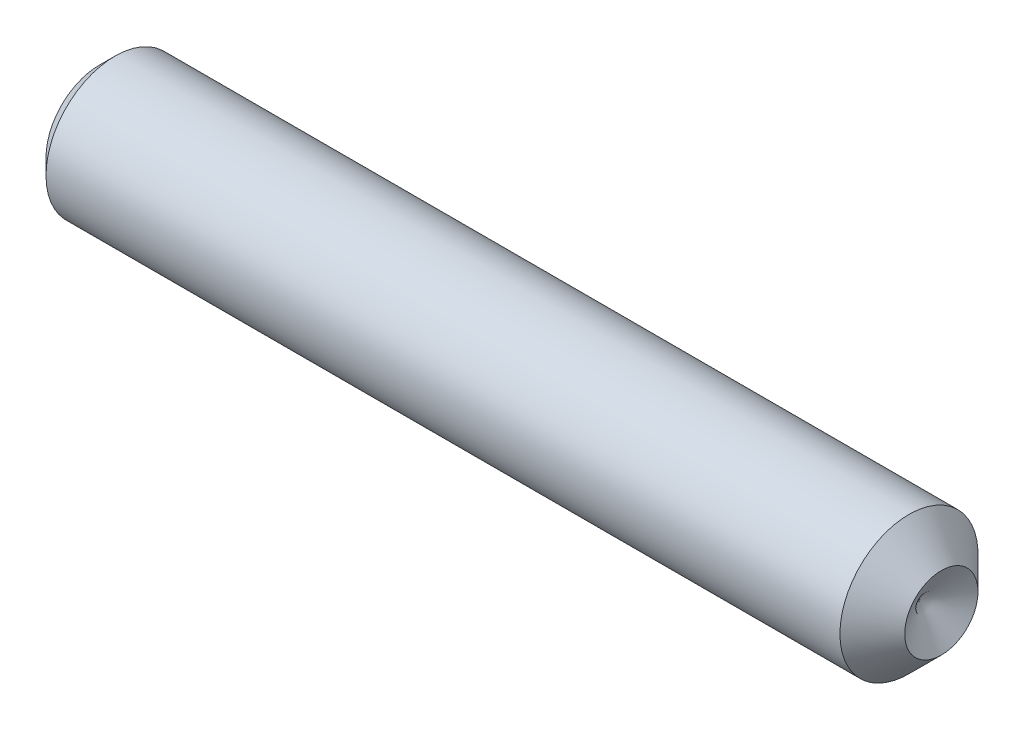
ISO-10303-21;
HEADER;
FILE_DESCRIPTION(('STEP AP214'),'2;1');
FILE_NAME('part.step','',(''),(''),'','','');
FILE_SCHEMA(('AUTOMOTIVE_DESIGN { 1 0 10303 214 1 1 1 1 }'));
ENDSEC;
DATA;
#1=APPLICATION_CONTEXT('core data for automotive mechanical design processes');
#2=APPLICATION_PROTOCOL_DEFINITION('international standard','automotive_design',2000,#1);
#3=PRODUCT_CONTEXT('',#1,'mechanical');
#4=PRODUCT('Part','Part','',(#3));
#5=PRODUCT_RELATED_PRODUCT_CATEGORY('part','',(#4));
#6=PRODUCT_DEFINITION_FORMATION('','',#4);
#7=PRODUCT_DEFINITION_CONTEXT('part definition',#1,'design');
#8=PRODUCT_DEFINITION('design','',#6,#7);
#9=PRODUCT_DEFINITION_SHAPE('','',#8);
#10=(LENGTH_UNIT() NAMED_UNIT(*) SI_UNIT(.MILLI.,.METRE.));
#11=(NAMED_UNIT(*) PLANE_ANGLE_UNIT() SI_UNIT($,.RADIAN.));
#12=(NAMED_UNIT(*) SI_UNIT($,.STERADIAN.) SOLID_ANGLE_UNIT());
#13=UNCERTAINTY_MEASURE_WITH_UNIT(LENGTH_MEASURE(1.E-05),#10,'distance_accuracy_value','');
#14=(GEOMETRIC_REPRESENTATION_CONTEXT(3) GLOBAL_UNCERTAINTY_ASSIGNED_CONTEXT((#13)) GLOBAL_UNIT_ASSIGNED_CONTEXT((#10,
#11,#12)) REPRESENTATION_CONTEXT('',''));
#15=CARTESIAN_POINT('',(0.,0.,0.));
#16=DIRECTION('',(0.,0.,1.));
#17=DIRECTION('',(1.,0.,0.));
#18=AXIS2_PLACEMENT_3D('',#15,#16,#17);
#19=CARTESIAN_POINT('',(0.,0.,0.));
#20=DIRECTION('',(-1.,0.,0.));
#21=DIRECTION('',(0.,0.,1.));
#22=AXIS2_PLACEMENT_3D('',#19,#20,#21);
#23=PLANE('',#22);
#24=CARTESIAN_POINT('',(0.,0.,0.));
#25=DIRECTION('',(-1.,0.,0.));
#26=DIRECTION('',(0.,0.,1.));
#27=AXIS2_PLACEMENT_3D('',#24,#25,#26);
#28=CIRCLE('',#27,1.61036);
#29=CARTESIAN_POINT('',(0.,0.,1.61036));
#30=VERTEX_POINT('',#29);
#31=EDGE_CURVE('E11',#30,#30,#28,.T.);
#32=ORIENTED_EDGE('',*,*,#31,.T.);
#33=EDGE_LOOP('',(#32));
#34=FACE_BOUND('',#33,.T.);
#35=DIRECTION('',(0.,0.,-1.));
#36=VECTOR('',#35,1.);
#37=CARTESIAN_POINT('',(0.,0.990600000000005,0.571923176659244));
#38=LINE('',#37,#36);
#39=CARTESIAN_POINT('',(0.,0.990600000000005,0.571923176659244));
#40=VERTEX_POINT('',#39);
#41=CARTESIAN_POINT('',(0.,0.990600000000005,-0.571923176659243));
#42=VERTEX_POINT('',#41);
#43=EDGE_CURVE('E94',#40,#42,#38,.T.);
#44=ORIENTED_EDGE('',*,*,#43,.F.);
#45=DIRECTION('',(0.,-0.866025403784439,0.5));
#46=VECTOR('',#45,1.);
#47=CARTESIAN_POINT('',(0.,0.990600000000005,0.571923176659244));
#48=LINE('',#47,#46);
#49=CARTESIAN_POINT('',(0.,0.,1.14384635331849));
#50=VERTEX_POINT('',#49);
#51=EDGE_CURVE('E47',#40,#50,#48,.T.);
#52=ORIENTED_EDGE('',*,*,#51,.T.);
#53=DIRECTION('',(0.,0.866025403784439,0.5));
#54=VECTOR('',#53,1.);
#55=CARTESIAN_POINT('',(0.,-0.990599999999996,0.571923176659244));
#56=LINE('',#55,#54);
#57=CARTESIAN_POINT('',(0.,-0.990599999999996,0.571923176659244));
#58=VERTEX_POINT('',#57);
#59=EDGE_CURVE('E100',#58,#50,#56,.T.);
#60=ORIENTED_EDGE('',*,*,#59,.F.);
#61=DIRECTION('',(0.,0.,-1.));
#62=VECTOR('',#61,1.);
#63=CARTESIAN_POINT('',(0.,-0.990599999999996,0.571923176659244));
#64=LINE('',#63,#62);
#65=CARTESIAN_POINT('',(0.,-0.990599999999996,-0.571923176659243));
#66=VERTEX_POINT('',#65);
#67=EDGE_CURVE('E120',#58,#66,#64,.T.);
#68=ORIENTED_EDGE('',*,*,#67,.T.);
#69=DIRECTION('',(0.,0.866025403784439,-0.5));
#70=VECTOR('',#69,1.);
#71=CARTESIAN_POINT('',(0.,-0.990599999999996,-0.571923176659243));
#72=LINE('',#71,#70);
#73=CARTESIAN_POINT('',(0.,0.,-1.14384635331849));
#74=VERTEX_POINT('',#73);
#75=EDGE_CURVE('E123',#66,#74,#72,.T.);
#76=ORIENTED_EDGE('',*,*,#75,.T.);
#77=DIRECTION('',(0.,-0.866025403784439,-0.5));
#78=VECTOR('',#77,1.);
#79=CARTESIAN_POINT('',(0.,0.990600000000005,-0.571923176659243));
#80=LINE('',#79,#78);
#81=EDGE_CURVE('E126',#42,#74,#80,.T.);
#82=ORIENTED_EDGE('',*,*,#81,.F.);
#83=EDGE_LOOP('',(#44,#52,#60,#68,#76,#82));
#84=FACE_BOUND('',#83,.T.);
#85=ADVANCED_FACE('F33',(#34,#84),#23,.T.);
#86=CARTESIAN_POINT('',(0.,0.,0.));
#87=DIRECTION('',(1.,0.,0.));
#88=DIRECTION('',(0.,0.,-1.));
#89=AXIS2_PLACEMENT_3D('',#86,#87,#88);
#90=CONICAL_SURFACE('',#89,1.61036,0.78539816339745);
#91=CARTESIAN_POINT('',(0.472439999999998,0.,0.));
#92=DIRECTION('',(-1.,0.,0.));
#93=DIRECTION('',(0.,0.,1.));
#94=AXIS2_PLACEMENT_3D('',#91,#92,#93);
#95=CIRCLE('',#94,2.0828);
#96=CARTESIAN_POINT('',(0.472439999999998,0.,2.0828));
#97=VERTEX_POINT('',#96);
#98=EDGE_CURVE('E40',#97,#97,#95,.T.);
#99=ORIENTED_EDGE('',*,*,#98,.T.);
#100=EDGE_LOOP('',(#99));
#101=FACE_BOUND('',#100,.T.);
#102=ORIENTED_EDGE('',*,*,#31,.F.);
#103=EDGE_LOOP('',(#102));
#104=FACE_BOUND('',#103,.T.);
#105=ADVANCED_FACE('F146',(#101,#104),#90,.T.);
#106=CARTESIAN_POINT('',(-12.7,0.,0.));
#107=DIRECTION('',(-1.,0.,0.));
#108=DIRECTION('',(0.,0.,1.));
#109=AXIS2_PLACEMENT_3D('',#106,#107,#108);
#110=CYLINDRICAL_SURFACE('',#109,2.0828);
#111=CARTESIAN_POINT('',(24.4221,0.,0.));
#112=DIRECTION('',(-1.,0.,0.));
#113=DIRECTION('',(0.,0.,1.));
#114=AXIS2_PLACEMENT_3D('',#111,#112,#113);
#115=CIRCLE('',#114,2.0828);
#116=CARTESIAN_POINT('',(24.4221,0.,2.0828));
#117=VERTEX_POINT('',#116);
#118=EDGE_CURVE('E141',#117,#117,#115,.T.);
#119=ORIENTED_EDGE('',*,*,#118,.T.);
#120=EDGE_LOOP('',(#119));
#121=FACE_BOUND('',#120,.T.);
#122=ORIENTED_EDGE('',*,*,#98,.F.);
#123=EDGE_LOOP('',(#122));
#124=FACE_BOUND('',#123,.T.);
#125=ADVANCED_FACE('F149',(#121,#124),#110,.T.);
#126=CARTESIAN_POINT('',(24.4221,0.,0.));
#127=DIRECTION('',(-1.,0.,0.));
#128=DIRECTION('',(0.,0.,1.));
#129=AXIS2_PLACEMENT_3D('',#126,#127,#128);
#130=CONICAL_SURFACE('',#129,2.0828,0.785398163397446);
#131=CARTESIAN_POINT('',(25.4,0.,0.));
#132=DIRECTION('',(-1.,0.,0.));
#133=DIRECTION('',(0.,0.,1.));
#134=AXIS2_PLACEMENT_3D('',#131,#132,#133);
#135=CIRCLE('',#134,1.1049);
#136=CARTESIAN_POINT('',(25.4,0.,1.1049));
#137=VERTEX_POINT('',#136);
#138=EDGE_CURVE('E101',#137,#137,#135,.T.);
#139=ORIENTED_EDGE('',*,*,#138,.T.);
#140=EDGE_LOOP('',(#139));
#141=FACE_BOUND('',#140,.T.);
#142=ORIENTED_EDGE('',*,*,#118,.F.);
#143=EDGE_LOOP('',(#142));
#144=FACE_BOUND('',#143,.T.);
#145=ADVANCED_FACE('F151',(#141,#144),#130,.T.);
#146=CARTESIAN_POINT('',(24.7361091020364,0.,0.));
#147=DIRECTION('',(1.,0.,0.));
#148=DIRECTION('',(0.,0.,-1.));
#149=AXIS2_PLACEMENT_3D('',#146,#147,#148);
#150=CONICAL_SURFACE('',#149,0.,1.02974425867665);
#151=ORIENTED_EDGE('',*,*,#138,.F.);
#152=EDGE_LOOP('',(#151));
#153=FACE_BOUND('',#152,.T.);
#154=CARTESIAN_POINT('',(24.7361091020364,0.,0.));
#155=VERTEX_POINT('',#154);
#156=VERTEX_LOOP('',#155);
#157=FACE_BOUND('',#156,.T.);
#158=ADVANCED_FACE('F158',(#153,#157),#150,.F.);
#159=CARTESIAN_POINT('',(2.286,0.990600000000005,0.571923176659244));
#160=DIRECTION('',(0.,-0.5,-0.866025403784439));
#161=DIRECTION('',(0.,0.866025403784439,-0.5));
#162=AXIS2_PLACEMENT_3D('',#159,#160,#161);
#163=PLANE('',#162);
#164=ORIENTED_EDGE('',*,*,#51,.F.);
#165=DIRECTION('',(-1.,0.,0.));
#166=VECTOR('',#165,1.);
#167=CARTESIAN_POINT('',(2.286,0.990600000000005,0.571923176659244));
#168=LINE('',#167,#166);
#169=CARTESIAN_POINT('',(2.286,0.990600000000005,0.571923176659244));
#170=VERTEX_POINT('',#169);
#171=EDGE_CURVE('E88',#170,#40,#168,.T.);
#172=ORIENTED_EDGE('',*,*,#171,.F.);
#173=DIRECTION('',(0.,-0.866025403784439,0.5));
#174=VECTOR('',#173,1.);
#175=CARTESIAN_POINT('',(2.286,0.990600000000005,0.571923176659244));
#176=LINE('',#175,#174);
#177=CARTESIAN_POINT('',(2.286,0.,1.14384635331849));
#178=VERTEX_POINT('',#177);
#179=EDGE_CURVE('E83',#170,#178,#176,.T.);
#180=ORIENTED_EDGE('',*,*,#179,.T.);
#181=DIRECTION('',(-1.,0.,0.));
#182=VECTOR('',#181,1.);
#183=CARTESIAN_POINT('',(2.286,0.,1.14384635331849));
#184=LINE('',#183,#182);
#185=EDGE_CURVE('E86',#178,#50,#184,.T.);
#186=ORIENTED_EDGE('',*,*,#185,.T.);
#187=EDGE_LOOP('',(#164,#172,#180,#186));
#188=FACE_BOUND('',#187,.T.);
#189=ADVANCED_FACE('F85',(#188),#163,.T.);
#190=CARTESIAN_POINT('',(2.286,-0.990599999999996,0.571923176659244));
#191=DIRECTION('',(0.,-0.5,0.866025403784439));
#192=DIRECTION('',(0.,-0.866025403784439,-0.5));
#193=AXIS2_PLACEMENT_3D('',#190,#191,#192);
#194=PLANE('',#193);
#195=ORIENTED_EDGE('',*,*,#59,.T.);
#196=ORIENTED_EDGE('',*,*,#185,.F.);
#197=DIRECTION('',(0.,0.866025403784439,0.5));
#198=VECTOR('',#197,1.);
#199=CARTESIAN_POINT('',(2.286,-0.990599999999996,0.571923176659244));
#200=LINE('',#199,#198);
#201=CARTESIAN_POINT('',(2.286,-0.990599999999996,0.571923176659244));
#202=VERTEX_POINT('',#201);
#203=EDGE_CURVE('E93',#202,#178,#200,.T.);
#204=ORIENTED_EDGE('',*,*,#203,.F.);
#205=DIRECTION('',(-1.,0.,0.));
#206=VECTOR('',#205,1.);
#207=CARTESIAN_POINT('',(2.286,-0.990599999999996,0.571923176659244));
#208=LINE('',#207,#206);
#209=EDGE_CURVE('E102',#202,#58,#208,.T.);
#210=ORIENTED_EDGE('',*,*,#209,.T.);
#211=EDGE_LOOP('',(#195,#196,#204,#210));
#212=FACE_BOUND('',#211,.T.);
#213=ADVANCED_FACE('F98',(#212),#194,.F.);
#214=CARTESIAN_POINT('',(2.286,-0.990599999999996,0.571923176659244));
#215=DIRECTION('',(0.,1.,0.));
#216=DIRECTION('',(0.,0.,1.));
#217=AXIS2_PLACEMENT_3D('',#214,#215,#216);
#218=PLANE('',#217);
#219=ORIENTED_EDGE('',*,*,#67,.F.);
#220=ORIENTED_EDGE('',*,*,#209,.F.);
#221=DIRECTION('',(0.,0.,-1.));
#222=VECTOR('',#221,1.);
#223=CARTESIAN_POINT('',(2.286,-0.990599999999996,0.571923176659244));
#224=LINE('',#223,#222);
#225=CARTESIAN_POINT('',(2.286,-0.990599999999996,-0.571923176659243));
#226=VERTEX_POINT('',#225);
#227=EDGE_CURVE('E107',#202,#226,#224,.T.);
#228=ORIENTED_EDGE('',*,*,#227,.T.);
#229=DIRECTION('',(-1.,0.,0.));
#230=VECTOR('',#229,1.);
#231=CARTESIAN_POINT('',(2.286,-0.990599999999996,-0.571923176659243));
#232=LINE('',#231,#230);
#233=EDGE_CURVE('E136',#226,#66,#232,.T.);
#234=ORIENTED_EDGE('',*,*,#233,.T.);
#235=EDGE_LOOP('',(#219,#220,#228,#234));
#236=FACE_BOUND('',#235,.T.);
#237=ADVANCED_FACE('F181',(#236),#218,.T.);
#238=CARTESIAN_POINT('',(2.286,-0.990599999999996,-0.571923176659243));
#239=DIRECTION('',(0.,0.5,0.866025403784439));
#240=DIRECTION('',(0.,-0.866025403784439,0.5));
#241=AXIS2_PLACEMENT_3D('',#238,#239,#240);
#242=PLANE('',#241);
#243=ORIENTED_EDGE('',*,*,#75,.F.);
#244=ORIENTED_EDGE('',*,*,#233,.F.);
#245=DIRECTION('',(0.,0.866025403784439,-0.5));
#246=VECTOR('',#245,1.);
#247=CARTESIAN_POINT('',(2.286,-0.990599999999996,-0.571923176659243));
#248=LINE('',#247,#246);
#249=CARTESIAN_POINT('',(2.286,0.,-1.14384635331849));
#250=VERTEX_POINT('',#249);
#251=EDGE_CURVE('E109',#226,#250,#248,.T.);
#252=ORIENTED_EDGE('',*,*,#251,.T.);
#253=DIRECTION('',(-1.,0.,0.));
#254=VECTOR('',#253,1.);
#255=CARTESIAN_POINT('',(2.286,0.,-1.14384635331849));
#256=LINE('',#255,#254);
#257=EDGE_CURVE('E134',#250,#74,#256,.T.);
#258=ORIENTED_EDGE('',*,*,#257,.T.);
#259=EDGE_LOOP('',(#243,#244,#252,#258));
#260=FACE_BOUND('',#259,.T.);
#261=ADVANCED_FACE('F177',(#260),#242,.T.);
#262=CARTESIAN_POINT('',(2.286,0.990600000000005,-0.571923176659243));
#263=DIRECTION('',(0.,0.5,-0.866025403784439));
#264=DIRECTION('',(0.,0.866025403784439,0.5));
#265=AXIS2_PLACEMENT_3D('',#262,#263,#264);
#266=PLANE('',#265);
#267=ORIENTED_EDGE('',*,*,#81,.T.);
#268=ORIENTED_EDGE('',*,*,#257,.F.);
#269=DIRECTION('',(0.,-0.866025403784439,-0.5));
#270=VECTOR('',#269,1.);
#271=CARTESIAN_POINT('',(2.286,0.990600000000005,-0.571923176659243));
#272=LINE('',#271,#270);
#273=CARTESIAN_POINT('',(2.286,0.990600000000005,-0.571923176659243));
#274=VERTEX_POINT('',#273);
#275=EDGE_CURVE('E113',#274,#250,#272,.T.);
#276=ORIENTED_EDGE('',*,*,#275,.F.);
#277=DIRECTION('',(-1.,0.,0.));
#278=VECTOR('',#277,1.);
#279=CARTESIAN_POINT('',(2.286,0.990600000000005,-0.571923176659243));
#280=LINE('',#279,#278);
#281=EDGE_CURVE('E132',#274,#42,#280,.T.);
#282=ORIENTED_EDGE('',*,*,#281,.T.);
#283=EDGE_LOOP('',(#267,#268,#276,#282));
#284=FACE_BOUND('',#283,.T.);
#285=ADVANCED_FACE('F174',(#284),#266,.F.);
#286=CARTESIAN_POINT('',(2.286,0.990600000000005,0.571923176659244));
#287=DIRECTION('',(0.,1.,0.));
#288=DIRECTION('',(0.,0.,1.));
#289=AXIS2_PLACEMENT_3D('',#286,#287,#288);
#290=PLANE('',#289);
#291=ORIENTED_EDGE('',*,*,#43,.T.);
#292=ORIENTED_EDGE('',*,*,#281,.F.);
#293=DIRECTION('',(0.,0.,-1.));
#294=VECTOR('',#293,1.);
#295=CARTESIAN_POINT('',(2.286,0.990600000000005,0.571923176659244));
#296=LINE('',#295,#294);
#297=EDGE_CURVE('E116',#170,#274,#296,.T.);
#298=ORIENTED_EDGE('',*,*,#297,.F.);
#299=ORIENTED_EDGE('',*,*,#171,.T.);
#300=EDGE_LOOP('',(#291,#292,#298,#299));
#301=FACE_BOUND('',#300,.T.);
#302=ADVANCED_FACE('F170',(#301),#290,.F.);
#303=CARTESIAN_POINT('',(2.286,-0.990599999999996,1.71576952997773));
#304=DIRECTION('',(1.,0.,0.));
#305=DIRECTION('',(0.,0.,-1.));
#306=AXIS2_PLACEMENT_3D('',#303,#304,#305);
#307=PLANE('',#306);
#308=ORIENTED_EDGE('',*,*,#179,.F.);
#309=ORIENTED_EDGE('',*,*,#297,.T.);
#310=ORIENTED_EDGE('',*,*,#275,.T.);
#311=ORIENTED_EDGE('',*,*,#251,.F.);
#312=ORIENTED_EDGE('',*,*,#227,.F.);
#313=ORIENTED_EDGE('',*,*,#203,.T.);
#314=EDGE_LOOP('',(#308,#309,#310,#311,#312,#313));
#315=FACE_BOUND('',#314,.T.);
#316=ADVANCED_FACE('F105',(#315),#307,.F.);
#317=CLOSED_SHELL('',(#85,#105,#125,#145,#158,#189,#213,#237,#261,#285,#302,#316));
#318=MANIFOLD_SOLID_BREP('B2',#317);
#319=ADVANCED_BREP_SHAPE_REPRESENTATION('',(#18,#318),#14);
#320=SHAPE_DEFINITION_REPRESENTATION(#9,#319);
ENDSEC;
END-ISO-10303-21;
